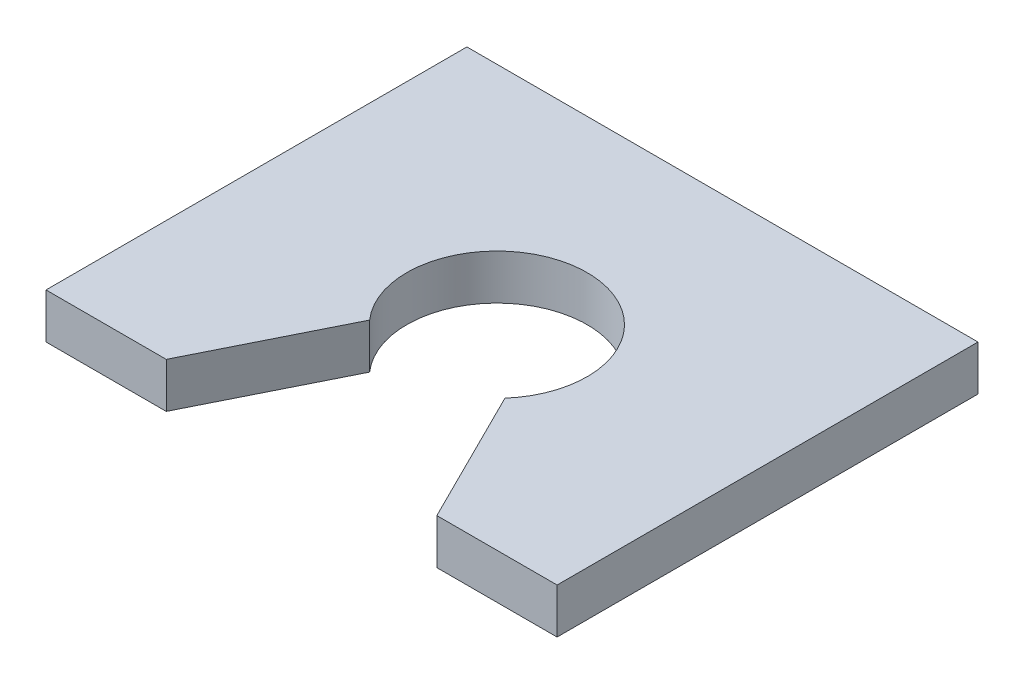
from build123d import *

# Parameters (mm, degrees)
EXTRUDE1_DEPTH = 3


with BuildPart() as part:
    # Sketch1 → Extrude1 (new body)
    with BuildSketch(Plane(origin=(0, 0, 0), x_dir=(1, 0, 0), z_dir=(0, 1, 0))):
        with BuildLine():
            Line((26, 0), (34, 0))
            Line((34, 0), (34, 28))
            Line((34, 28), (0, 28))
            Line((0, 28), (0, 0))
            Line((0, 0), (8, 0))
            Line((8, 0), (12.500000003, 9.03137303))
            ThreePointArc((12.500000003, 9.03137303), (17, 19), (21.499999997, 9.03137303))
            Line((21.499999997, 9.03137303), (26, 0))
        make_face()
    extrude(amount=EXTRUDE1_DEPTH)


solid = part.part
